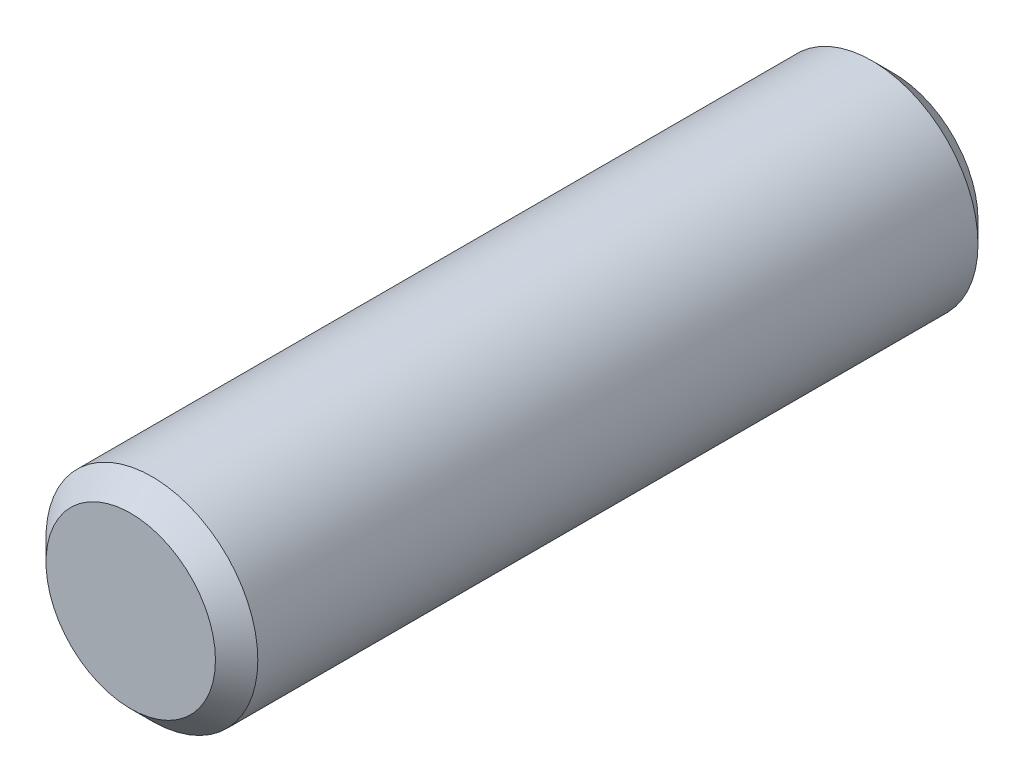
from build123d import *

# Parameters (mm, degrees)
ESQUISSE1_R          = 2.5
BASE_EXTRUSION_DEPTH = 18
CHANFREIN1_SIZE      = 0.5


with BuildPart() as part:
    # Esquisse1 → Base-Extrusion (new body)
    with BuildSketch(Plane.XY):
        Circle(ESQUISSE1_R)
    extrude(amount=BASE_EXTRUSION_DEPTH)

    # Chanfrein1
    chanfrein1_edges = [part.edges().sort_by_distance(p)[0] for p in [
        (-2.5, 0, 0),
        (-2.5, 0, 18),
    ]]
    chamfer(chanfrein1_edges, length=CHANFREIN1_SIZE)


solid = part.part
